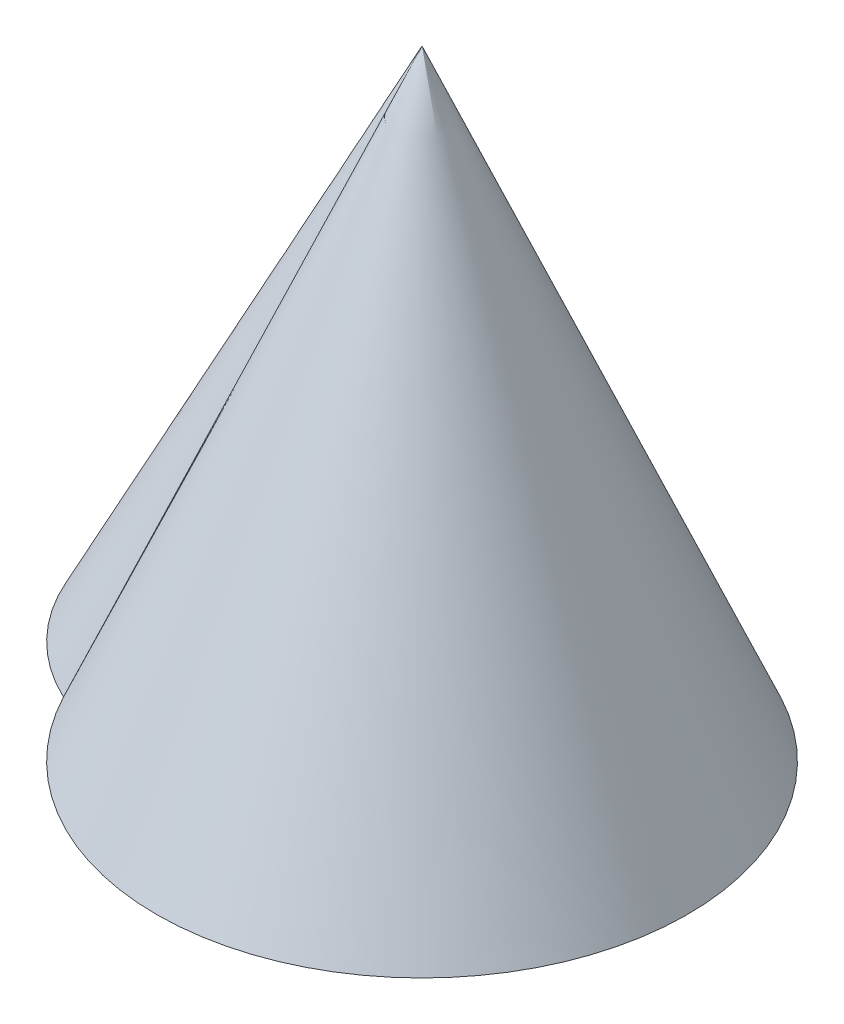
ISO-10303-21;
HEADER;
FILE_DESCRIPTION(('STEP AP214'),'2;1');
FILE_NAME('part.step','',(''),(''),'','','');
FILE_SCHEMA(('AUTOMOTIVE_DESIGN { 1 0 10303 214 1 1 1 1 }'));
ENDSEC;
DATA;
#1=APPLICATION_CONTEXT('core data for automotive mechanical design processes');
#2=APPLICATION_PROTOCOL_DEFINITION('international standard','automotive_design',2000,#1);
#3=PRODUCT_CONTEXT('',#1,'mechanical');
#4=PRODUCT('Part','Part','',(#3));
#5=PRODUCT_RELATED_PRODUCT_CATEGORY('part','',(#4));
#6=PRODUCT_DEFINITION_FORMATION('','',#4);
#7=PRODUCT_DEFINITION_CONTEXT('part definition',#1,'design');
#8=PRODUCT_DEFINITION('design','',#6,#7);
#9=PRODUCT_DEFINITION_SHAPE('','',#8);
#10=(LENGTH_UNIT() NAMED_UNIT(*) SI_UNIT(.MILLI.,.METRE.));
#11=(NAMED_UNIT(*) PLANE_ANGLE_UNIT() SI_UNIT($,.RADIAN.));
#12=(NAMED_UNIT(*) SI_UNIT($,.STERADIAN.) SOLID_ANGLE_UNIT());
#13=UNCERTAINTY_MEASURE_WITH_UNIT(LENGTH_MEASURE(1.E-05),#10,'distance_accuracy_value','');
#14=(GEOMETRIC_REPRESENTATION_CONTEXT(3) GLOBAL_UNCERTAINTY_ASSIGNED_CONTEXT((#13)) GLOBAL_UNIT_ASSIGNED_CONTEXT((#10,
#11,#12)) REPRESENTATION_CONTEXT('',''));
#15=CARTESIAN_POINT('',(0.,0.,0.));
#16=DIRECTION('',(0.,0.,1.));
#17=DIRECTION('',(1.,0.,0.));
#18=AXIS2_PLACEMENT_3D('',#15,#16,#17);
#19=CARTESIAN_POINT('',(-8.5,0.,-3.2));
#20=DIRECTION('',(0.,1.,0.));
#21=DIRECTION('',(0.,0.,1.));
#22=AXIS2_PLACEMENT_3D('',#19,#20,#21);
#23=PLANE('',#22);
#24=CARTESIAN_POINT('',(-17.,0.,-6.4));
#25=DIRECTION('',(0.,1.,0.));
#26=DIRECTION('',(0.,0.,1.));
#27=AXIS2_PLACEMENT_3D('',#24,#25,#26);
#28=CIRCLE('',#27,22.5);
#29=CARTESIAN_POINT('',(-10.7400313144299,0.,-28.0116355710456));
#30=VERTEX_POINT('',#29);
#31=CARTESIAN_POINT('',(-26.5465185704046,0.,13.9743462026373));
#32=VERTEX_POINT('',#31);
#33=EDGE_CURVE('E85',#30,#32,#28,.T.);
#34=ORIENTED_EDGE('',*,*,#33,.F.);
#35=CARTESIAN_POINT('',(0.,0.,0.));
#36=DIRECTION('',(0.,1.,0.));
#37=DIRECTION('',(0.,0.,1.));
#38=AXIS2_PLACEMENT_3D('',#35,#36,#37);
#39=CIRCLE('',#38,30.);
#40=EDGE_CURVE('E83',#32,#30,#39,.T.);
#41=ORIENTED_EDGE('',*,*,#40,.F.);
#42=EDGE_LOOP('',(#34,#41));
#43=FACE_BOUND('',#42,.T.);
#44=ADVANCED_FACE('F55',(#43),#23,.F.);
#45=CARTESIAN_POINT('',(0.,70.,0.));
#46=CARTESIAN_POINT('',(-26.5465185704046,0.,13.9743462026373));
#47=CARTESIAN_POINT('',(0.,70.,0.));
#48=CARTESIAN_POINT('',(-27.3928607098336,0.,13.5777876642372));
#49=CARTESIAN_POINT('',(0.,70.,0.));
#50=CARTESIAN_POINT('',(-28.2638994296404,0.,13.1057060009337));
#51=CARTESIAN_POINT('',(0.,70.,0.));
#52=CARTESIAN_POINT('',(-30.0280239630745,0.,11.974400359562));
#53=CARTESIAN_POINT('',(0.,70.,0.));
#54=CARTESIAN_POINT('',(-30.9212554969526,0.,11.3149462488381));
#55=CARTESIAN_POINT('',(0.,70.,0.));
#56=CARTESIAN_POINT('',(-32.68464594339,0.,9.77444146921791));
#57=CARTESIAN_POINT('',(0.,70.,0.));
#58=CARTESIAN_POINT('',(-33.554850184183,0.,8.89301472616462));
#59=CARTESIAN_POINT('',(0.,70.,0.));
#60=CARTESIAN_POINT('',(-35.2057139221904,0.,6.88500450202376));
#61=CARTESIAN_POINT('',(0.,70.,0.));
#62=CARTESIAN_POINT('',(-35.9861845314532,0.,5.75794039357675));
#63=CARTESIAN_POINT('',(0.,70.,0.));
#64=CARTESIAN_POINT('',(-37.3713605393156,0.,3.25910904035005));
#65=CARTESIAN_POINT('',(0.,70.,0.));
#66=CARTESIAN_POINT('',(-37.9755229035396,0.,1.88692799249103));
#67=CARTESIAN_POINT('',(0.,70.,0.));
#68=CARTESIAN_POINT('',(-38.9127083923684,0.,-1.06343298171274));
#69=CARTESIAN_POINT('',(0.,70.,0.));
#70=CARTESIAN_POINT('',(-39.2448683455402,0.,-2.64166251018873));
#71=CARTESIAN_POINT('',(0.,70.,0.));
#72=CARTESIAN_POINT('',(-39.5549972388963,0.,-5.91899277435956));
#73=CARTESIAN_POINT('',(0.,70.,0.));
#74=CARTESIAN_POINT('',(-39.5320991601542,0.,-7.61752714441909));
#75=CARTESIAN_POINT('',(0.,70.,0.));
#76=CARTESIAN_POINT('',(-39.0888534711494,0.,-11.0109019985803));
#77=CARTESIAN_POINT('',(0.,70.,0.));
#78=CARTESIAN_POINT('',(-38.6681359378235,0.,-12.7046428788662));
#79=CARTESIAN_POINT('',(0.,70.,0.));
#80=CARTESIAN_POINT('',(-37.4462805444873,0.,-15.9501962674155));
#81=CARTESIAN_POINT('',(0.,70.,0.));
#82=CARTESIAN_POINT('',(-36.6455676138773,0.,-17.5008800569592));
#83=CARTESIAN_POINT('',(0.,70.,0.));
#84=CARTESIAN_POINT('',(-34.7409255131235,0.,-20.3440821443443));
#85=CARTESIAN_POINT('',(0.,70.,0.));
#86=CARTESIAN_POINT('',(-33.6379995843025,0.,-21.6360177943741));
#87=CARTESIAN_POINT('',(0.,70.,0.));
#88=CARTESIAN_POINT('',(-31.2435534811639,0.,-23.8951551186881));
#89=CARTESIAN_POINT('',(0.,70.,0.));
#90=CARTESIAN_POINT('',(-29.9530585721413,0.,-24.8625028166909));
#91=CARTESIAN_POINT('',(0.,70.,0.));
#92=CARTESIAN_POINT('',(-27.3028644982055,0.,-26.4623208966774));
#93=CARTESIAN_POINT('',(0.,70.,0.));
#94=CARTESIAN_POINT('',(-25.9437814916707,0.,-27.0953978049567));
#95=CARTESIAN_POINT('',(0.,70.,0.));
#96=CARTESIAN_POINT('',(-23.2545926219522,0.,-28.0603506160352));
#97=CARTESIAN_POINT('',(0.,70.,0.));
#98=CARTESIAN_POINT('',(-21.924622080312,0.,-28.3928957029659));
#99=CARTESIAN_POINT('',(0.,70.,0.));
#100=CARTESIAN_POINT('',(-19.3593921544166,0.,-28.8136706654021));
#101=CARTESIAN_POINT('',(0.,70.,0.));
#102=CARTESIAN_POINT('',(-18.1239578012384,0.,-28.9023864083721));
#103=CARTESIAN_POINT('',(0.,70.,0.));
#104=CARTESIAN_POINT('',(-15.782446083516,0.,-28.8975162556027));
#105=CARTESIAN_POINT('',(0.,70.,0.));
#106=CARTESIAN_POINT('',(-14.676086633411,0.,-28.8041831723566));
#107=CARTESIAN_POINT('',(0.,70.,0.));
#108=CARTESIAN_POINT('',(-12.6038792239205,0.,-28.4912226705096));
#109=CARTESIAN_POINT('',(0.,70.,0.));
#110=CARTESIAN_POINT('',(-11.6377699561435,0.,-28.2716721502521));
#111=CARTESIAN_POINT('',(0.,70.,0.));
#112=CARTESIAN_POINT('',(-10.7400313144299,0.,-28.0116355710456));
#113=B_SPLINE_SURFACE_WITH_KNOTS('',3,1,((#45,#46),(#47,#48),(#49,#50),(#51,#52),(#53,#54),(#55,
#56),(#57,#58),(#59,#60),(#61,#62),(#63,#64),(#65,#66),(#67,#68),(#69,#70),(#71,#72),(#73,#74),
(#75,#76),(#77,#78),(#79,#80),(#81,#82),(#83,#84),(#85,#86),(#87,#88),(#89,#90),(#91,#92),(#93,
#94),(#95,#96),(#97,#98),(#99,#100),(#101,#102),(#103,#104),(#105,#106),(#107,#108),(#109,#110),
(#111,#112)),.UNSPECIFIED.,.F.,.F.,.F.,(4,2,2,2,2,2,2,2,2,2,2,2,2,2,2,2,4),(2,2),(0.,
0.0624999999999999,0.125,0.1875,0.25,0.3125,0.375,0.4375,0.5,0.5625,0.625,0.6875,0.75,0.8125,
0.875,0.9375,1.),(0.,1.),.UNSPECIFIED.);
#114=DIRECTION('',(-0.141023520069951,-0.919145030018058,-0.367810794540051));
#115=VECTOR('',#114,1.);
#116=CARTESIAN_POINT('',(-5.37001565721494,35.,-14.0058177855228));
#117=LINE('',#116,#115);
#118=CARTESIAN_POINT('',(0.,70.,0.));
#119=VERTEX_POINT('',#118);
#120=EDGE_CURVE('E12',#119,#30,#117,.T.);
#121=DIRECTION('',(0.348572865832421,0.919145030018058,-0.183492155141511));
#122=VECTOR('',#121,1.);
#123=CARTESIAN_POINT('',(-13.2732592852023,35.,6.98717310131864));
#124=LINE('',#123,#122);
#125=EDGE_CURVE('E68',#32,#119,#124,.T.);
#126=ORIENTED_EDGE('',*,*,#120,.T.);
#127=ORIENTED_EDGE('',*,*,#33,.T.);
#128=ORIENTED_EDGE('',*,*,#125,.T.);
#129=EDGE_LOOP('',(#126,#127,#128));
#130=FACE_BOUND('',#129,.T.);
#131=ADVANCED_FACE('F92',(#130),#113,.T.);
#132=CARTESIAN_POINT('',(0.,70.,0.));
#133=DIRECTION('',(0.,-1.,0.));
#134=DIRECTION('',(0.,0.,-1.));
#135=AXIS2_PLACEMENT_3D('',#132,#133,#134);
#136=CONICAL_SURFACE('',#135,0.,0.404891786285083);
#137=ORIENTED_EDGE('',*,*,#125,.F.);
#138=ORIENTED_EDGE('',*,*,#40,.T.);
#139=ORIENTED_EDGE('',*,*,#120,.F.);
#140=EDGE_LOOP('',(#137,#138,#139));
#141=FACE_BOUND('',#140,.T.);
#142=ADVANCED_FACE('F57',(#141),#136,.T.);
#143=CLOSED_SHELL('',(#44,#131,#142));
#144=MANIFOLD_SOLID_BREP('B2',#143);
#145=ADVANCED_BREP_SHAPE_REPRESENTATION('',(#18,#144),#14);
#146=SHAPE_DEFINITION_REPRESENTATION(#9,#145);
ENDSEC;
END-ISO-10303-21;
